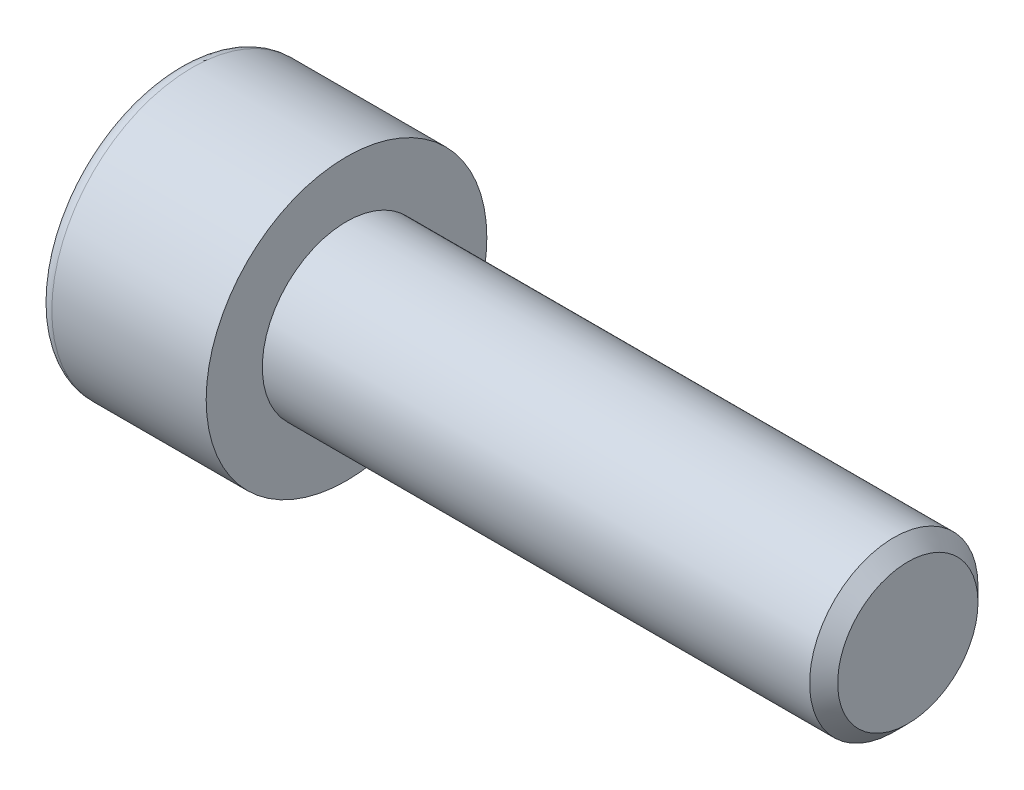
from build123d import *

# Parameters (mm, degrees)
CHANFREIN_TIGE_SIZE     = 0.5
CONG_TETE_R             = 0.5
ENL_V_MAT_EXTRU_1_DEPTH = 3.78


with BuildPart() as part:
    # Esquisse1 → Base-R_volution (revolve)
    with BuildSketch(Plane.XY, mode=Mode.PRIVATE) as base_r_volution_sk:
        Polygon((0, 3), (0, 5), (-6, 5), (-6, 0), (20, 0), (20, 3), align=None)
    revolve(base_r_volution_sk.sketch.rotate(Axis((12.501307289, 0, 0), (-1, 0, 0)), 90), axis=Axis((12.501307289, 0, 0), (-1, 0, 0)))

    # Chanfrein tige
    chanfrein_tige_edges = [part.edges().sort_by_distance(p)[0] for p in [
        (20, 0, 3),
    ]]
    chamfer(chanfrein_tige_edges, length=CHANFREIN_TIGE_SIZE)

    # Cong_ tete
    cong_tete_edges = [part.edges().sort_by_distance(p)[0] for p in [
        (-6, 0, 5),
    ]]
    fillet(cong_tete_edges, radius=CONG_TETE_R)

    # Esquisse2 → Enl_v. mat.-Extru.1 (cut)
    with BuildSketch(Plane.ZY.offset(6)):
        Polygon((2.886751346, 0), (1.443375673, 2.5), (-1.443375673, 2.5), (-2.886751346, 0), (-1.443375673, -2.5), (1.443375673, -2.5), align=None)
    extrude(amount=-ENL_V_MAT_EXTRU_1_DEPTH, mode=Mode.SUBTRACT)


solid = part.part
